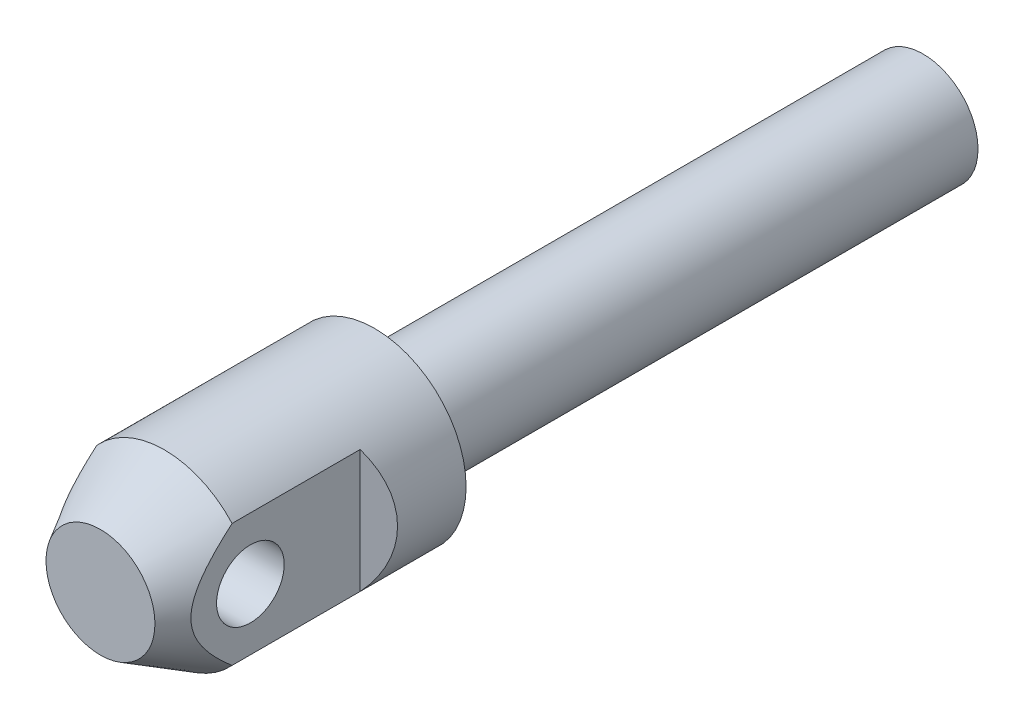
ISO-10303-21;
HEADER;
FILE_DESCRIPTION(('STEP AP214'),'2;1');
FILE_NAME('part.step','',(''),(''),'','','');
FILE_SCHEMA(('AUTOMOTIVE_DESIGN { 1 0 10303 214 1 1 1 1 }'));
ENDSEC;
DATA;
#1=APPLICATION_CONTEXT('core data for automotive mechanical design processes');
#2=APPLICATION_PROTOCOL_DEFINITION('international standard','automotive_design',2000,#1);
#3=PRODUCT_CONTEXT('',#1,'mechanical');
#4=PRODUCT('Part','Part','',(#3));
#5=PRODUCT_RELATED_PRODUCT_CATEGORY('part','',(#4));
#6=PRODUCT_DEFINITION_FORMATION('','',#4);
#7=PRODUCT_DEFINITION_CONTEXT('part definition',#1,'design');
#8=PRODUCT_DEFINITION('design','',#6,#7);
#9=PRODUCT_DEFINITION_SHAPE('','',#8);
#10=(LENGTH_UNIT() NAMED_UNIT(*) SI_UNIT(.MILLI.,.METRE.));
#11=(NAMED_UNIT(*) PLANE_ANGLE_UNIT() SI_UNIT($,.RADIAN.));
#12=(NAMED_UNIT(*) SI_UNIT($,.STERADIAN.) SOLID_ANGLE_UNIT());
#13=UNCERTAINTY_MEASURE_WITH_UNIT(LENGTH_MEASURE(1.E-05),#10,'distance_accuracy_value','');
#14=(GEOMETRIC_REPRESENTATION_CONTEXT(3) GLOBAL_UNCERTAINTY_ASSIGNED_CONTEXT((#13)) GLOBAL_UNIT_ASSIGNED_CONTEXT((#10,
#11,#12)) REPRESENTATION_CONTEXT('',''));
#15=CARTESIAN_POINT('',(0.,0.,0.));
#16=DIRECTION('',(0.,0.,1.));
#17=DIRECTION('',(1.,0.,0.));
#18=AXIS2_PLACEMENT_3D('',#15,#16,#17);
#19=CARTESIAN_POINT('',(0.,0.,20.));
#20=DIRECTION('',(0.,0.,1.));
#21=DIRECTION('',(1.,0.,0.));
#22=AXIS2_PLACEMENT_3D('',#19,#20,#21);
#23=CYLINDRICAL_SURFACE('',#22,5.);
#24=CARTESIAN_POINT('',(0.,0.,0.));
#25=DIRECTION('',(0.,0.,1.));
#26=DIRECTION('',(1.,0.,0.));
#27=AXIS2_PLACEMENT_3D('',#24,#25,#26);
#28=CIRCLE('',#27,5.);
#29=CARTESIAN_POINT('',(5.,0.,0.));
#30=VERTEX_POINT('',#29);
#31=EDGE_CURVE('E82',#30,#30,#28,.T.);
#32=ORIENTED_EDGE('',*,*,#31,.T.);
#33=EDGE_LOOP('',(#32));
#34=FACE_BOUND('',#33,.T.);
#35=CARTESIAN_POINT('',(0.,0.,11.5));
#36=DIRECTION('',(0.,0.,1.));
#37=DIRECTION('',(1.,0.,0.));
#38=AXIS2_PLACEMENT_3D('',#35,#36,#37);
#39=CIRCLE('',#38,5.);
#40=CARTESIAN_POINT('',(-3.7,-3.36303434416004,11.5));
#41=VERTEX_POINT('',#40);
#42=CARTESIAN_POINT('',(3.7,-3.36303434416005,11.5));
#43=VERTEX_POINT('',#42);
#44=EDGE_CURVE('E67',#41,#43,#39,.T.);
#45=ORIENTED_EDGE('',*,*,#44,.F.);
#46=DIRECTION('',(0.,0.,1.));
#47=VECTOR('',#46,1.);
#48=CARTESIAN_POINT('',(-3.7,-3.36303434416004,20.));
#49=LINE('',#48,#47);
#50=CARTESIAN_POINT('',(-3.7,-3.36303434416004,4.5));
#51=VERTEX_POINT('',#50);
#52=EDGE_CURVE('E30',#41,#51,#49,.F.);
#53=ORIENTED_EDGE('',*,*,#52,.T.);
#54=CARTESIAN_POINT('',(0.,0.,6.63619599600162));
#55=DIRECTION('',(0.5,0.,-0.866025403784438));
#56=DIRECTION('',(0.866025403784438,0.,0.5));
#57=AXIS2_PLACEMENT_3D('',#54,#55,#56);
#58=ELLIPSE('',#57,5.77350269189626,5.);
#59=CARTESIAN_POINT('',(-3.7,3.36303434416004,4.5));
#60=VERTEX_POINT('',#59);
#61=EDGE_CURVE('E9',#60,#51,#58,.F.);
#62=ORIENTED_EDGE('',*,*,#61,.F.);
#63=DIRECTION('',(0.,0.,1.));
#64=VECTOR('',#63,1.);
#65=CARTESIAN_POINT('',(-3.7,3.36303434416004,20.));
#66=LINE('',#65,#64);
#67=CARTESIAN_POINT('',(-3.7,3.36303434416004,11.5));
#68=VERTEX_POINT('',#67);
#69=EDGE_CURVE('E63',#60,#68,#66,.T.);
#70=ORIENTED_EDGE('',*,*,#69,.T.);
#71=CARTESIAN_POINT('',(3.7,3.36303434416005,11.5));
#72=VERTEX_POINT('',#71);
#73=EDGE_CURVE('E79',#72,#68,#39,.T.);
#74=ORIENTED_EDGE('',*,*,#73,.F.);
#75=DIRECTION('',(0.,0.,1.));
#76=VECTOR('',#75,1.);
#77=CARTESIAN_POINT('',(3.7,3.36303434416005,20.));
#78=LINE('',#77,#76);
#79=CARTESIAN_POINT('',(3.7,3.36303434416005,4.5));
#80=VERTEX_POINT('',#79);
#81=EDGE_CURVE('E38',#80,#72,#78,.T.);
#82=ORIENTED_EDGE('',*,*,#81,.F.);
#83=CARTESIAN_POINT('',(0.,0.,6.63619599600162));
#84=DIRECTION('',(0.5,0.,0.866025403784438));
#85=DIRECTION('',(-0.866025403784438,0.,0.5));
#86=AXIS2_PLACEMENT_3D('',#83,#84,#85);
#87=ELLIPSE('',#86,5.77350269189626,5.);
#88=CARTESIAN_POINT('',(3.7,-3.36303434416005,4.5));
#89=VERTEX_POINT('',#88);
#90=EDGE_CURVE('E99',#80,#89,#87,.F.);
#91=ORIENTED_EDGE('',*,*,#90,.T.);
#92=DIRECTION('',(0.,0.,1.));
#93=VECTOR('',#92,1.);
#94=CARTESIAN_POINT('',(3.7,-3.36303434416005,20.));
#95=LINE('',#94,#93);
#96=EDGE_CURVE('E74',#43,#89,#95,.F.);
#97=ORIENTED_EDGE('',*,*,#96,.F.);
#98=EDGE_LOOP('',(#45,#53,#62,#70,#74,#82,#91,#97));
#99=FACE_BOUND('',#98,.T.);
#100=ADVANCED_FACE('F14',(#34,#99),#23,.T.);
#101=CARTESIAN_POINT('',(0.,0.,15.));
#102=DIRECTION('',(0.,0.,-1.));
#103=DIRECTION('',(-1.,0.,0.));
#104=AXIS2_PLACEMENT_3D('',#101,#102,#103);
#105=CONICAL_SURFACE('',#104,2.9792740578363,0.523598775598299);
#106=CARTESIAN_POINT('',(0.,0.,15.));
#107=DIRECTION('',(0.,0.,1.));
#108=DIRECTION('',(1.,0.,0.));
#109=AXIS2_PLACEMENT_3D('',#106,#107,#108);
#110=CIRCLE('',#109,2.9792740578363);
#111=CARTESIAN_POINT('',(2.9792740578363,0.,15.));
#112=VERTEX_POINT('',#111);
#113=EDGE_CURVE('E76',#112,#112,#110,.T.);
#114=ORIENTED_EDGE('',*,*,#113,.F.);
#115=EDGE_LOOP('',(#114));
#116=FACE_BOUND('',#115,.T.);
#117=ORIENTED_EDGE('',*,*,#73,.T.);
#118=CARTESIAN_POINT('',(-3.7,-6.88307017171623,6.62511587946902));
#119=CARTESIAN_POINT('',(-3.7,-6.73833515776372,6.84589126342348));
#120=CARTESIAN_POINT('',(-3.7,-6.59291105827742,7.0662188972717));
#121=CARTESIAN_POINT('',(-3.7,-6.30033326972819,7.50575042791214));
#122=CARTESIAN_POINT('',(-3.7,-6.15317942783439,7.72495422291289));
#123=CARTESIAN_POINT('',(-3.7,-5.85630301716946,8.16272745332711));
#124=CARTESIAN_POINT('',(-3.7,-5.70657331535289,8.38129206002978));
#125=CARTESIAN_POINT('',(-3.7,-5.4045777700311,8.81665051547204));
#126=CARTESIAN_POINT('',(-3.7,-5.25231203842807,9.033444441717));
#127=CARTESIAN_POINT('',(-3.7,-4.93959274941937,9.47182261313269));
#128=CARTESIAN_POINT('',(-3.7,-4.7790341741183,9.69333217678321));
#129=CARTESIAN_POINT('',(-3.7,-4.45360648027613,10.1331533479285));
#130=CARTESIAN_POINT('',(-3.7,-4.28873757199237,10.3514651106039));
#131=CARTESIAN_POINT('',(-3.7,-3.95358291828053,10.7834352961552));
#132=CARTESIAN_POINT('',(-3.7,-3.78330512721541,10.9970998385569));
#133=CARTESIAN_POINT('',(-3.7,-3.52220916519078,11.3128625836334));
#134=CARTESIAN_POINT('',(-3.7,-3.43424061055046,11.4173166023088));
#135=CARTESIAN_POINT('',(-3.7,-3.25606095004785,11.6242909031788));
#136=CARTESIAN_POINT('',(-3.7,-3.16584995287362,11.7268112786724));
#137=CARTESIAN_POINT('',(-3.7,-2.9770828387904,11.9357614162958));
#138=CARTESIAN_POINT('',(-3.7,-2.8783565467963,12.0420380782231));
#139=CARTESIAN_POINT('',(-3.7,-2.67726468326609,12.2511563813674));
#140=CARTESIAN_POINT('',(-3.7,-2.57489824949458,12.3539971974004));
#141=CARTESIAN_POINT('',(-3.7,-2.36601212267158,12.5548988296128));
#142=CARTESIAN_POINT('',(-3.7,-2.25950289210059,12.6529704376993));
#143=CARTESIAN_POINT('',(-3.7,-2.04117968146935,12.8429765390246));
#144=CARTESIAN_POINT('',(-3.7,-1.92936775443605,12.9349133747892));
#145=CARTESIAN_POINT('',(-3.7,-1.67081054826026,13.1321107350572));
#146=CARTESIAN_POINT('',(-3.7,-1.52225833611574,13.2350531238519));
#147=CARTESIAN_POINT('',(-3.7,-1.21293438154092,13.4207618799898));
#148=CARTESIAN_POINT('',(-3.7,-1.05218706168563,13.5035672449));
#149=CARTESIAN_POINT('',(-3.7,-0.763418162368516,13.6198541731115));
#150=CARTESIAN_POINT('',(-3.7,-0.638434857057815,13.6606291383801));
#151=CARTESIAN_POINT('',(-3.7,-0.447314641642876,13.7059326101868));
#152=CARTESIAN_POINT('',(-3.7,-0.383025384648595,13.7183888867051));
#153=CARTESIAN_POINT('',(-3.7,-0.253611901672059,13.7375973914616));
#154=CARTESIAN_POINT('',(-3.7,-0.188488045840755,13.744352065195));
#155=CARTESIAN_POINT('',(-3.7,-0.0574941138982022,13.7519008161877));
#156=CARTESIAN_POINT('',(-3.7,0.00837809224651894,13.7526584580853));
#157=CARTESIAN_POINT('',(-3.7,0.139898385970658,13.7481008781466));
#158=CARTESIAN_POINT('',(-3.7,0.205546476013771,13.7427857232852));
#159=CARTESIAN_POINT('',(-3.7,0.401356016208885,13.717996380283));
#160=CARTESIAN_POINT('',(-3.7,0.530452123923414,13.6896819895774));
#161=CARTESIAN_POINT('',(-3.7,0.824518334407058,13.6007661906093));
#162=CARTESIAN_POINT('',(-3.7,0.98711272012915,13.5325512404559));
#163=CARTESIAN_POINT('',(-3.7,1.22231030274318,13.4122918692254));
#164=CARTESIAN_POINT('',(-3.7,1.29967191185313,13.3689194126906));
#165=CARTESIAN_POINT('',(-3.7,1.45144802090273,13.2773068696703));
#166=CARTESIAN_POINT('',(-3.7,1.52586344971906,13.2290683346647));
#167=CARTESIAN_POINT('',(-3.7,1.70779437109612,13.1040762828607));
#168=CARTESIAN_POINT('',(-3.7,1.81365739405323,13.0249345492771));
#169=CARTESIAN_POINT('',(-3.7,2.02032688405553,12.8602589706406));
#170=CARTESIAN_POINT('',(-3.7,2.12113020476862,12.7747212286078));
#171=CARTESIAN_POINT('',(-3.7,2.31881213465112,12.5985709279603));
#172=CARTESIAN_POINT('',(-3.7,2.41567560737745,12.5079414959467));
#173=CARTESIAN_POINT('',(-3.7,2.60582960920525,12.3230041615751));
#174=CARTESIAN_POINT('',(-3.7,2.6991196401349,12.2286957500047));
#175=CARTESIAN_POINT('',(-3.7,2.87693541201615,12.0432265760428));
#176=CARTESIAN_POINT('',(-3.7,2.96164365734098,11.9522399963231));
#177=CARTESIAN_POINT('',(-3.7,3.12882416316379,11.7682260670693));
#178=CARTESIAN_POINT('',(-3.7,3.21129622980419,11.6751985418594));
#179=CARTESIAN_POINT('',(-3.7,3.3736032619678,11.4883079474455));
#180=CARTESIAN_POINT('',(-3.7,3.45345505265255,11.3944594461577));
#181=CARTESIAN_POINT('',(-3.7,3.61150133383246,11.2054158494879));
#182=CARTESIAN_POINT('',(-3.7,3.68969623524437,11.1102210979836));
#183=CARTESIAN_POINT('',(-3.7,3.76719687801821,11.0144726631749));
#184=B_SPLINE_CURVE_WITH_KNOTS('',3,(#118,#119,#120,#121,#122,#123,#124,#125,#126,#127,#128,
#129,#130,#131,#132,#133,#134,#135,#136,#137,#138,#139,#140,#141,#142,#143,#144,#145,#146,#147,
#148,#149,#150,#151,#152,#153,#154,#155,#156,#157,#158,#159,#160,#161,#162,#163,#164,#165,#166,
#167,#168,#169,#170,#171,#172,#173,#174,#175,#176,#177,#178,#179,#180,#181,#182,#183),
.UNSPECIFIED.,.F.,.F.,(4,2,2,2,2,2,2,2,2,2,2,2,2,2,2,2,2,2,2,2,2,2,2,2,2,2,2,2,2,2,2,2,4),(0.,
0.791969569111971,1.58400964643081,2.37879371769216,3.17354281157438,3.9942386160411,
4.81489446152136,5.63439473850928,6.04405485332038,6.45369515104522,6.88879788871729,
7.32400438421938,7.75817528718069,8.19217944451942,8.7333841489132,9.27353225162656,
9.66629783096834,9.86253211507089,10.058682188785,10.2560230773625,10.4533617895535,
10.8478339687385,11.3737159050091,11.6396756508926,11.9055508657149,12.3017340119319,
12.6981605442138,13.0959886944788,13.493872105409,13.8667722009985,14.2397045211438,
14.6093533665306,14.9789094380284),.UNSPECIFIED.);
#185=EDGE_CURVE('E23',#68,#41,#184,.F.);
#186=ORIENTED_EDGE('',*,*,#185,.T.);
#187=ORIENTED_EDGE('',*,*,#44,.T.);
#188=CARTESIAN_POINT('',(3.7,-6.88307017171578,6.62511587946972));
#189=CARTESIAN_POINT('',(3.7,-6.73833515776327,6.84589126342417));
#190=CARTESIAN_POINT('',(3.7,-6.59291105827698,7.06621889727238));
#191=CARTESIAN_POINT('',(3.7,-6.30033326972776,7.50575042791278));
#192=CARTESIAN_POINT('',(3.7,-6.15317942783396,7.72495422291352));
#193=CARTESIAN_POINT('',(3.7,-5.85630301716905,8.16272745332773));
#194=CARTESIAN_POINT('',(3.7,-5.70657331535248,8.38129206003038));
#195=CARTESIAN_POINT('',(3.7,-5.4045777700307,8.81665051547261));
#196=CARTESIAN_POINT('',(3.7,-5.25231203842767,9.03344444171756));
#197=CARTESIAN_POINT('',(3.7,-4.93959274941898,9.47182261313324));
#198=CARTESIAN_POINT('',(3.7,-4.77903417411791,9.69333217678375));
#199=CARTESIAN_POINT('',(3.7,-4.45360648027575,10.133153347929));
#200=CARTESIAN_POINT('',(3.7,-4.28873757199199,10.3514651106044));
#201=CARTESIAN_POINT('',(3.7,-3.95358291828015,10.7834352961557));
#202=CARTESIAN_POINT('',(3.7,-3.78330512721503,10.9970998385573));
#203=CARTESIAN_POINT('',(3.7,-3.5222091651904,11.3128625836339));
#204=CARTESIAN_POINT('',(3.7,-3.43424061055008,11.4173166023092));
#205=CARTESIAN_POINT('',(3.7,-3.25606095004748,11.6242909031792));
#206=CARTESIAN_POINT('',(3.7,-3.16584995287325,11.7268112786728));
#207=CARTESIAN_POINT('',(3.7,-2.97708283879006,11.9357614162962));
#208=CARTESIAN_POINT('',(3.7,-2.87835654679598,12.0420380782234));
#209=CARTESIAN_POINT('',(3.7,-2.6772646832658,12.2511563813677));
#210=CARTESIAN_POINT('',(3.7,-2.57489824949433,12.3539971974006));
#211=CARTESIAN_POINT('',(3.7,-2.36601212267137,12.554898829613));
#212=CARTESIAN_POINT('',(3.7,-2.2595028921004,12.6529704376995));
#213=CARTESIAN_POINT('',(3.7,-2.04117968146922,12.8429765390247));
#214=CARTESIAN_POINT('',(3.7,-1.92936775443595,12.9349133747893));
#215=CARTESIAN_POINT('',(3.7,-1.67081054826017,13.1321107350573));
#216=CARTESIAN_POINT('',(3.7,-1.52225833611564,13.235053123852));
#217=CARTESIAN_POINT('',(3.7,-1.21293438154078,13.4207618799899));
#218=CARTESIAN_POINT('',(3.7,-1.05218706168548,13.5035672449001));
#219=CARTESIAN_POINT('',(3.7,-0.763418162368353,13.6198541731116));
#220=CARTESIAN_POINT('',(3.7,-0.638434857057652,13.6606291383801));
#221=CARTESIAN_POINT('',(3.7,-0.44731464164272,13.7059326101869));
#222=CARTESIAN_POINT('',(3.7,-0.38302538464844,13.7183888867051));
#223=CARTESIAN_POINT('',(3.7,-0.25361190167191,13.7375973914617));
#224=CARTESIAN_POINT('',(3.7,-0.188488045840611,13.7443520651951));
#225=CARTESIAN_POINT('',(3.7,-0.0574941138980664,13.7519008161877));
#226=CARTESIAN_POINT('',(3.7,0.00837809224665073,13.7526584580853));
#227=CARTESIAN_POINT('',(3.7,0.139898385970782,13.7481008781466));
#228=CARTESIAN_POINT('',(3.7,0.20554647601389,13.7427857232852));
#229=CARTESIAN_POINT('',(3.7,0.401356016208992,13.717996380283));
#230=CARTESIAN_POINT('',(3.7,0.530452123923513,13.6896819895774));
#231=CARTESIAN_POINT('',(3.7,0.824518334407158,13.6007661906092));
#232=CARTESIAN_POINT('',(3.7,0.987112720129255,13.5325512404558));
#233=CARTESIAN_POINT('',(3.7,1.22231030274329,13.4122918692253));
#234=CARTESIAN_POINT('',(3.7,1.29967191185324,13.3689194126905));
#235=CARTESIAN_POINT('',(3.7,1.45144802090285,13.2773068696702));
#236=CARTESIAN_POINT('',(3.7,1.52586344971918,13.2290683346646));
#237=CARTESIAN_POINT('',(3.7,1.70779437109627,13.1040762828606));
#238=CARTESIAN_POINT('',(3.7,1.81365739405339,13.024934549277));
#239=CARTESIAN_POINT('',(3.7,2.0203268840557,12.8602589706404));
#240=CARTESIAN_POINT('',(3.7,2.12113020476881,12.7747212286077));
#241=CARTESIAN_POINT('',(3.7,2.31881213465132,12.5985709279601));
#242=CARTESIAN_POINT('',(3.7,2.41567560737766,12.5079414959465));
#243=CARTESIAN_POINT('',(3.7,2.60582960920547,12.3230041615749));
#244=CARTESIAN_POINT('',(3.7,2.69911964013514,12.2286957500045));
#245=CARTESIAN_POINT('',(3.7,2.8769354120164,12.0432265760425));
#246=CARTESIAN_POINT('',(3.7,2.96164365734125,11.9522399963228));
#247=CARTESIAN_POINT('',(3.7,3.12882416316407,11.768226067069));
#248=CARTESIAN_POINT('',(3.7,3.21129622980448,11.6751985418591));
#249=CARTESIAN_POINT('',(3.7,3.37360326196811,11.4883079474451));
#250=CARTESIAN_POINT('',(3.7,3.45345505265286,11.3944594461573));
#251=CARTESIAN_POINT('',(3.7,3.6115013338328,11.2054158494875));
#252=CARTESIAN_POINT('',(3.7,3.68969623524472,11.1102210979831));
#253=CARTESIAN_POINT('',(3.7,3.76719687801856,11.0144726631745));
#254=B_SPLINE_CURVE_WITH_KNOTS('',3,(#188,#189,#190,#191,#192,#193,#194,#195,#196,#197,#198,
#199,#200,#201,#202,#203,#204,#205,#206,#207,#208,#209,#210,#211,#212,#213,#214,#215,#216,#217,
#218,#219,#220,#221,#222,#223,#224,#225,#226,#227,#228,#229,#230,#231,#232,#233,#234,#235,#236,
#237,#238,#239,#240,#241,#242,#243,#244,#245,#246,#247,#248,#249,#250,#251,#252,#253),
.UNSPECIFIED.,.F.,.F.,(4,2,2,2,2,2,2,2,2,2,2,2,2,2,2,2,2,2,2,2,2,2,2,2,2,2,2,2,2,2,2,2,4),(0.,
0.791969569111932,1.58400964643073,2.37879371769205,3.17354281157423,3.99423861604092,
4.81489446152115,5.63439473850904,6.04405485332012,6.45369515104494,6.8887978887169,
7.32400438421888,7.75817528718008,8.19217944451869,8.73338414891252,9.27353225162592,
9.66629783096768,9.86253211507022,10.0586821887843,10.2560230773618,10.4533617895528,
10.8478339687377,11.3737159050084,11.6396756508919,11.9055508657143,12.3017340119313,
12.6981605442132,13.0959886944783,13.4938721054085,13.8667722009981,14.2397045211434,
14.6093533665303,14.9789094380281),.UNSPECIFIED.);
#255=EDGE_CURVE('E91',#72,#43,#254,.F.);
#256=ORIENTED_EDGE('',*,*,#255,.F.);
#257=EDGE_LOOP('',(#117,#186,#187,#256));
#258=FACE_BOUND('',#257,.T.);
#259=ADVANCED_FACE('F104',(#116,#258),#105,.T.);
#260=CARTESIAN_POINT('',(0.,2.9792740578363,15.));
#261=DIRECTION('',(0.,0.,-1.));
#262=DIRECTION('',(-1.,0.,0.));
#263=AXIS2_PLACEMENT_3D('',#260,#261,#262);
#264=PLANE('',#263);
#265=ORIENTED_EDGE('',*,*,#113,.T.);
#266=EDGE_LOOP('',(#265));
#267=FACE_BOUND('',#266,.T.);
#268=ADVANCED_FACE('F16',(#267),#264,.F.);
#269=CARTESIAN_POINT('',(0.,3.,-30.));
#270=DIRECTION('',(0.,0.,-1.));
#271=DIRECTION('',(-1.,0.,0.));
#272=AXIS2_PLACEMENT_3D('',#269,#270,#271);
#273=PLANE('',#272);
#274=CARTESIAN_POINT('',(0.,0.,-30.));
#275=DIRECTION('',(0.,0.,1.));
#276=DIRECTION('',(1.,0.,0.));
#277=AXIS2_PLACEMENT_3D('',#274,#275,#276);
#278=CIRCLE('',#277,3.);
#279=CARTESIAN_POINT('',(3.,0.,-30.));
#280=VERTEX_POINT('',#279);
#281=EDGE_CURVE('E88',#280,#280,#278,.T.);
#282=ORIENTED_EDGE('',*,*,#281,.F.);
#283=EDGE_LOOP('',(#282));
#284=FACE_BOUND('',#283,.T.);
#285=ADVANCED_FACE('F147',(#284),#273,.T.);
#286=CARTESIAN_POINT('',(0.,0.,20.));
#287=DIRECTION('',(0.,0.,1.));
#288=DIRECTION('',(1.,0.,0.));
#289=AXIS2_PLACEMENT_3D('',#286,#287,#288);
#290=CYLINDRICAL_SURFACE('',#289,3.);
#291=ORIENTED_EDGE('',*,*,#281,.T.);
#292=EDGE_LOOP('',(#291));
#293=FACE_BOUND('',#292,.T.);
#294=CARTESIAN_POINT('',(0.,0.,0.));
#295=DIRECTION('',(0.,0.,1.));
#296=DIRECTION('',(1.,0.,0.));
#297=AXIS2_PLACEMENT_3D('',#294,#295,#296);
#298=CIRCLE('',#297,3.);
#299=CARTESIAN_POINT('',(3.,0.,0.));
#300=VERTEX_POINT('',#299);
#301=EDGE_CURVE('E85',#300,#300,#298,.T.);
#302=ORIENTED_EDGE('',*,*,#301,.F.);
#303=EDGE_LOOP('',(#302));
#304=FACE_BOUND('',#303,.T.);
#305=ADVANCED_FACE('F134',(#293,#304),#290,.T.);
#306=CARTESIAN_POINT('',(0.,3.,0.));
#307=DIRECTION('',(0.,0.,1.));
#308=DIRECTION('',(1.,0.,0.));
#309=AXIS2_PLACEMENT_3D('',#306,#307,#308);
#310=PLANE('',#309);
#311=ORIENTED_EDGE('',*,*,#31,.F.);
#312=EDGE_LOOP('',(#311));
#313=FACE_BOUND('',#312,.T.);
#314=ORIENTED_EDGE('',*,*,#301,.T.);
#315=EDGE_LOOP('',(#314));
#316=FACE_BOUND('',#315,.T.);
#317=ADVANCED_FACE('F125',(#313,#316),#310,.F.);
#318=CARTESIAN_POINT('',(3.7,-15.,4.5));
#319=DIRECTION('',(0.5,0.,0.866025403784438));
#320=DIRECTION('',(0.866025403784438,0.,-0.5));
#321=AXIS2_PLACEMENT_3D('',#318,#319,#320);
#322=PLANE('',#321);
#323=DIRECTION('',(0.,1.,0.));
#324=VECTOR('',#323,1.);
#325=CARTESIAN_POINT('',(3.7,-15.,4.5));
#326=LINE('',#325,#324);
#327=EDGE_CURVE('E68',#89,#80,#326,.T.);
#328=ORIENTED_EDGE('',*,*,#327,.F.);
#329=ORIENTED_EDGE('',*,*,#90,.F.);
#330=EDGE_LOOP('',(#328,#329));
#331=FACE_BOUND('',#330,.T.);
#332=ADVANCED_FACE('F123',(#331),#322,.T.);
#333=CARTESIAN_POINT('',(3.7,-15.,4.5));
#334=DIRECTION('',(-1.,0.,0.));
#335=DIRECTION('',(0.,0.,1.));
#336=AXIS2_PLACEMENT_3D('',#333,#334,#335);
#337=PLANE('',#336);
#338=CARTESIAN_POINT('',(3.7,0.,10.5));
#339=DIRECTION('',(1.,0.,0.));
#340=DIRECTION('',(0.,0.,-1.));
#341=AXIS2_PLACEMENT_3D('',#338,#339,#340);
#342=CIRCLE('',#341,1.85);
#343=CARTESIAN_POINT('',(3.7,0.,8.65));
#344=VERTEX_POINT('',#343);
#345=EDGE_CURVE('E233',#344,#344,#342,.T.);
#346=ORIENTED_EDGE('',*,*,#345,.F.);
#347=EDGE_LOOP('',(#346));
#348=FACE_BOUND('',#347,.T.);
#349=ORIENTED_EDGE('',*,*,#96,.T.);
#350=ORIENTED_EDGE('',*,*,#327,.T.);
#351=ORIENTED_EDGE('',*,*,#81,.T.);
#352=ORIENTED_EDGE('',*,*,#255,.T.);
#353=EDGE_LOOP('',(#349,#350,#351,#352));
#354=FACE_BOUND('',#353,.T.);
#355=ADVANCED_FACE('F101',(#348,#354),#337,.F.);
#356=CARTESIAN_POINT('',(-3.7,-15.,4.5));
#357=DIRECTION('',(-1.,0.,0.));
#358=DIRECTION('',(0.,0.,1.));
#359=AXIS2_PLACEMENT_3D('',#356,#357,#358);
#360=PLANE('',#359);
#361=CARTESIAN_POINT('',(-3.7,0.,10.5));
#362=DIRECTION('',(-1.,0.,0.));
#363=DIRECTION('',(0.,0.,1.));
#364=AXIS2_PLACEMENT_3D('',#361,#362,#363);
#365=CIRCLE('',#364,1.85);
#366=CARTESIAN_POINT('',(-3.7,0.,12.35));
#367=VERTEX_POINT('',#366);
#368=EDGE_CURVE('E18',#367,#367,#365,.T.);
#369=ORIENTED_EDGE('',*,*,#368,.F.);
#370=EDGE_LOOP('',(#369));
#371=FACE_BOUND('',#370,.T.);
#372=ORIENTED_EDGE('',*,*,#185,.F.);
#373=ORIENTED_EDGE('',*,*,#69,.F.);
#374=DIRECTION('',(0.,1.,0.));
#375=VECTOR('',#374,1.);
#376=CARTESIAN_POINT('',(-3.7,-15.,4.5));
#377=LINE('',#376,#375);
#378=EDGE_CURVE('E59',#51,#60,#377,.T.);
#379=ORIENTED_EDGE('',*,*,#378,.F.);
#380=ORIENTED_EDGE('',*,*,#52,.F.);
#381=EDGE_LOOP('',(#372,#373,#379,#380));
#382=FACE_BOUND('',#381,.T.);
#383=ADVANCED_FACE('F62',(#371,#382),#360,.T.);
#384=CARTESIAN_POINT('',(-3.7,-15.,4.5));
#385=DIRECTION('',(0.5,0.,-0.866025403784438));
#386=DIRECTION('',(-0.866025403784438,0.,-0.5));
#387=AXIS2_PLACEMENT_3D('',#384,#385,#386);
#388=PLANE('',#387);
#389=ORIENTED_EDGE('',*,*,#61,.T.);
#390=ORIENTED_EDGE('',*,*,#378,.T.);
#391=EDGE_LOOP('',(#389,#390));
#392=FACE_BOUND('',#391,.T.);
#393=ADVANCED_FACE('F58',(#392),#388,.F.);
#394=CARTESIAN_POINT('',(-5.,0.,10.5));
#395=DIRECTION('',(1.,0.,0.));
#396=DIRECTION('',(0.,0.,-1.));
#397=AXIS2_PLACEMENT_3D('',#394,#395,#396);
#398=CYLINDRICAL_SURFACE('',#397,1.85);
#399=ORIENTED_EDGE('',*,*,#368,.T.);
#400=EDGE_LOOP('',(#399));
#401=FACE_BOUND('',#400,.T.);
#402=ORIENTED_EDGE('',*,*,#345,.T.);
#403=EDGE_LOOP('',(#402));
#404=FACE_BOUND('',#403,.T.);
#405=ADVANCED_FACE('F121',(#401,#404),#398,.F.);
#406=CLOSED_SHELL('',(#100,#259,#268,#285,#305,#317,#332,#355,#383,#393,#405));
#407=MANIFOLD_SOLID_BREP('B1',#406);
#408=ADVANCED_BREP_SHAPE_REPRESENTATION('',(#18,#407),#14);
#409=SHAPE_DEFINITION_REPRESENTATION(#9,#408);
ENDSEC;
END-ISO-10303-21;
